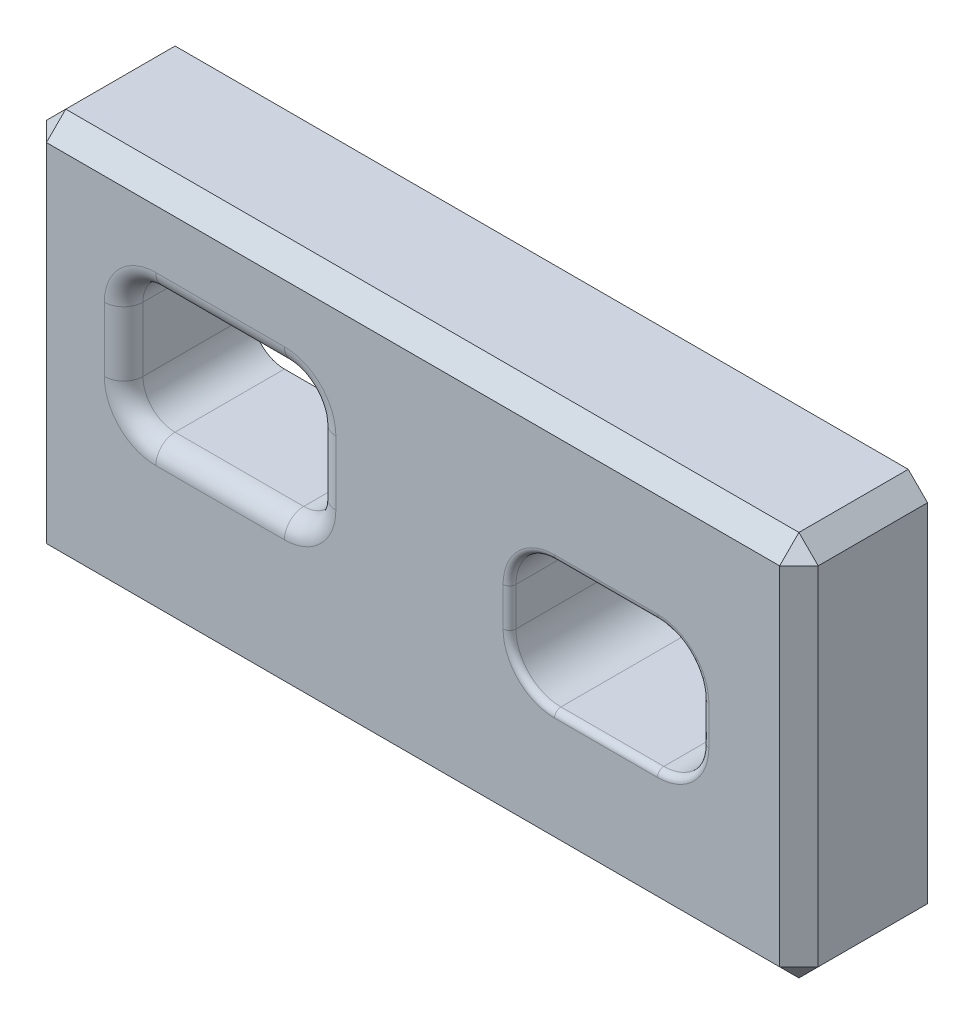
ISO-10303-21;
HEADER;
FILE_DESCRIPTION(('STEP AP214'),'2;1');
FILE_NAME('part.step','',(''),(''),'','','');
FILE_SCHEMA(('AUTOMOTIVE_DESIGN { 1 0 10303 214 1 1 1 1 }'));
ENDSEC;
DATA;
#1=APPLICATION_CONTEXT('core data for automotive mechanical design processes');
#2=APPLICATION_PROTOCOL_DEFINITION('international standard','automotive_design',2000,#1);
#3=PRODUCT_CONTEXT('',#1,'mechanical');
#4=PRODUCT('Part','Part','',(#3));
#5=PRODUCT_RELATED_PRODUCT_CATEGORY('part','',(#4));
#6=PRODUCT_DEFINITION_FORMATION('','',#4);
#7=PRODUCT_DEFINITION_CONTEXT('part definition',#1,'design');
#8=PRODUCT_DEFINITION('design','',#6,#7);
#9=PRODUCT_DEFINITION_SHAPE('','',#8);
#10=(LENGTH_UNIT() NAMED_UNIT(*) SI_UNIT(.MILLI.,.METRE.));
#11=(NAMED_UNIT(*) PLANE_ANGLE_UNIT() SI_UNIT($,.RADIAN.));
#12=(NAMED_UNIT(*) SI_UNIT($,.STERADIAN.) SOLID_ANGLE_UNIT());
#13=UNCERTAINTY_MEASURE_WITH_UNIT(LENGTH_MEASURE(1.E-05),#10,'distance_accuracy_value','');
#14=(GEOMETRIC_REPRESENTATION_CONTEXT(3) GLOBAL_UNCERTAINTY_ASSIGNED_CONTEXT((#13)) GLOBAL_UNIT_ASSIGNED_CONTEXT((#10,
#11,#12)) REPRESENTATION_CONTEXT('',''));
#15=CARTESIAN_POINT('',(0.,0.,0.));
#16=DIRECTION('',(0.,0.,1.));
#17=DIRECTION('',(1.,0.,0.));
#18=AXIS2_PLACEMENT_3D('',#15,#16,#17);
#19=CARTESIAN_POINT('',(0.,0.,20.));
#20=DIRECTION('',(1.,0.,0.));
#21=DIRECTION('',(0.,0.,-1.));
#22=AXIS2_PLACEMENT_3D('',#19,#20,#21);
#23=PLANE('',#22);
#24=DIRECTION('',(0.,-1.,0.));
#25=VECTOR('',#24,1.);
#26=CARTESIAN_POINT('',(0.,0.,0.));
#27=LINE('',#26,#25);
#28=CARTESIAN_POINT('',(0.,57.,0.));
#29=VERTEX_POINT('',#28);
#30=CARTESIAN_POINT('',(0.,3.,0.));
#31=VERTEX_POINT('',#30);
#32=EDGE_CURVE('E374',#29,#31,#27,.T.);
#33=ORIENTED_EDGE('',*,*,#32,.T.);
#34=DIRECTION('',(0.,0.,1.));
#35=VECTOR('',#34,1.);
#36=CARTESIAN_POINT('',(0.,3.,20.));
#37=LINE('',#36,#35);
#38=CARTESIAN_POINT('',(0.,3.,17.));
#39=VERTEX_POINT('',#38);
#40=EDGE_CURVE('E443',#31,#39,#37,.T.);
#41=ORIENTED_EDGE('',*,*,#40,.T.);
#42=DIRECTION('',(0.,1.,0.));
#43=VECTOR('',#42,1.);
#44=CARTESIAN_POINT('',(0.,0.,17.));
#45=LINE('',#44,#43);
#46=CARTESIAN_POINT('',(0.,57.,17.));
#47=VERTEX_POINT('',#46);
#48=EDGE_CURVE('E440',#39,#47,#45,.T.);
#49=ORIENTED_EDGE('',*,*,#48,.T.);
#50=DIRECTION('',(0.,0.,-1.));
#51=VECTOR('',#50,1.);
#52=CARTESIAN_POINT('',(0.,57.,20.));
#53=LINE('',#52,#51);
#54=EDGE_CURVE('E438',#47,#29,#53,.T.);
#55=ORIENTED_EDGE('',*,*,#54,.T.);
#56=EDGE_LOOP('',(#33,#41,#49,#55));
#57=FACE_BOUND('',#56,.T.);
#58=ADVANCED_FACE('F33',(#57),#23,.F.);
#59=CARTESIAN_POINT('',(0.,0.,20.));
#60=DIRECTION('',(0.,1.,0.));
#61=DIRECTION('',(0.,0.,1.));
#62=AXIS2_PLACEMENT_3D('',#59,#60,#61);
#63=PLANE('',#62);
#64=DIRECTION('',(-1.,0.,0.));
#65=VECTOR('',#64,1.);
#66=CARTESIAN_POINT('',(0.,0.,17.));
#67=LINE('',#66,#65);
#68=CARTESIAN_POINT('',(117.,0.,17.));
#69=VERTEX_POINT('',#68);
#70=CARTESIAN_POINT('',(3.00000000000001,0.,17.));
#71=VERTEX_POINT('',#70);
#72=EDGE_CURVE('E447',#69,#71,#67,.T.);
#73=ORIENTED_EDGE('',*,*,#72,.T.);
#74=DIRECTION('',(0.,0.,-1.));
#75=VECTOR('',#74,1.);
#76=CARTESIAN_POINT('',(3.00000000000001,0.,20.));
#77=LINE('',#76,#75);
#78=CARTESIAN_POINT('',(3.00000000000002,0.,0.));
#79=VERTEX_POINT('',#78);
#80=EDGE_CURVE('E449',#71,#79,#77,.T.);
#81=ORIENTED_EDGE('',*,*,#80,.T.);
#82=DIRECTION('',(1.,0.,0.));
#83=VECTOR('',#82,1.);
#84=CARTESIAN_POINT('',(0.,0.,0.));
#85=LINE('',#84,#83);
#86=CARTESIAN_POINT('',(117.,0.,0.));
#87=VERTEX_POINT('',#86);
#88=EDGE_CURVE('E533',#79,#87,#85,.T.);
#89=ORIENTED_EDGE('',*,*,#88,.T.);
#90=DIRECTION('',(0.,0.,1.));
#91=VECTOR('',#90,1.);
#92=CARTESIAN_POINT('',(117.,0.,20.));
#93=LINE('',#92,#91);
#94=EDGE_CURVE('E445',#87,#69,#93,.T.);
#95=ORIENTED_EDGE('',*,*,#94,.T.);
#96=EDGE_LOOP('',(#73,#81,#89,#95));
#97=FACE_BOUND('',#96,.T.);
#98=ADVANCED_FACE('F537',(#97),#63,.F.);
#99=CARTESIAN_POINT('',(120.,0.,20.));
#100=DIRECTION('',(-1.,0.,0.));
#101=DIRECTION('',(0.,0.,1.));
#102=AXIS2_PLACEMENT_3D('',#99,#100,#101);
#103=PLANE('',#102);
#104=DIRECTION('',(0.,-1.,0.));
#105=VECTOR('',#104,1.);
#106=CARTESIAN_POINT('',(120.,0.,17.));
#107=LINE('',#106,#105);
#108=CARTESIAN_POINT('',(120.,57.,17.));
#109=VERTEX_POINT('',#108);
#110=CARTESIAN_POINT('',(120.,3.,17.));
#111=VERTEX_POINT('',#110);
#112=EDGE_CURVE('E461',#109,#111,#107,.T.);
#113=ORIENTED_EDGE('',*,*,#112,.T.);
#114=DIRECTION('',(0.,0.,-1.));
#115=VECTOR('',#114,1.);
#116=CARTESIAN_POINT('',(120.,3.,20.));
#117=LINE('',#116,#115);
#118=CARTESIAN_POINT('',(120.,3.00000000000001,0.));
#119=VERTEX_POINT('',#118);
#120=EDGE_CURVE('E463',#111,#119,#117,.T.);
#121=ORIENTED_EDGE('',*,*,#120,.T.);
#122=DIRECTION('',(0.,1.,0.));
#123=VECTOR('',#122,1.);
#124=CARTESIAN_POINT('',(120.,0.,0.));
#125=LINE('',#124,#123);
#126=CARTESIAN_POINT('',(120.,57.,0.));
#127=VERTEX_POINT('',#126);
#128=EDGE_CURVE('E535',#119,#127,#125,.T.);
#129=ORIENTED_EDGE('',*,*,#128,.T.);
#130=DIRECTION('',(0.,0.,1.));
#131=VECTOR('',#130,1.);
#132=CARTESIAN_POINT('',(120.,57.,20.));
#133=LINE('',#132,#131);
#134=EDGE_CURVE('E459',#127,#109,#133,.T.);
#135=ORIENTED_EDGE('',*,*,#134,.T.);
#136=EDGE_LOOP('',(#113,#121,#129,#135));
#137=FACE_BOUND('',#136,.T.);
#138=ADVANCED_FACE('F522',(#137),#103,.F.);
#139=CARTESIAN_POINT('',(0.,60.,20.));
#140=DIRECTION('',(0.,-1.,0.));
#141=DIRECTION('',(0.,0.,-1.));
#142=AXIS2_PLACEMENT_3D('',#139,#140,#141);
#143=PLANE('',#142);
#144=DIRECTION('',(1.,0.,0.));
#145=VECTOR('',#144,1.);
#146=CARTESIAN_POINT('',(0.,60.,17.));
#147=LINE('',#146,#145);
#148=CARTESIAN_POINT('',(3.00000000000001,60.,17.));
#149=VERTEX_POINT('',#148);
#150=CARTESIAN_POINT('',(117.,60.,17.));
#151=VERTEX_POINT('',#150);
#152=EDGE_CURVE('E42',#149,#151,#147,.T.);
#153=ORIENTED_EDGE('',*,*,#152,.T.);
#154=DIRECTION('',(0.,0.,-1.));
#155=VECTOR('',#154,1.);
#156=CARTESIAN_POINT('',(117.,60.,20.));
#157=LINE('',#156,#155);
#158=CARTESIAN_POINT('',(117.,60.,0.));
#159=VERTEX_POINT('',#158);
#160=EDGE_CURVE('E11',#151,#159,#157,.T.);
#161=ORIENTED_EDGE('',*,*,#160,.T.);
#162=DIRECTION('',(-1.,0.,0.));
#163=VECTOR('',#162,1.);
#164=CARTESIAN_POINT('',(0.,60.,0.));
#165=LINE('',#164,#163);
#166=CARTESIAN_POINT('',(3.00000000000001,60.,0.));
#167=VERTEX_POINT('',#166);
#168=EDGE_CURVE('E540',#159,#167,#165,.T.);
#169=ORIENTED_EDGE('',*,*,#168,.T.);
#170=DIRECTION('',(0.,0.,1.));
#171=VECTOR('',#170,1.);
#172=CARTESIAN_POINT('',(3.00000000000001,60.,20.));
#173=LINE('',#172,#171);
#174=EDGE_CURVE('E53',#167,#149,#173,.T.);
#175=ORIENTED_EDGE('',*,*,#174,.T.);
#176=EDGE_LOOP('',(#153,#161,#169,#175));
#177=FACE_BOUND('',#176,.T.);
#178=ADVANCED_FACE('F771',(#177),#143,.F.);
#179=CARTESIAN_POINT('',(0.,60.,20.));
#180=DIRECTION('',(0.,0.,-1.));
#181=DIRECTION('',(-1.,0.,0.));
#182=AXIS2_PLACEMENT_3D('',#179,#180,#181);
#183=PLANE('',#182);
#184=DIRECTION('',(-1.,0.,0.));
#185=VECTOR('',#184,1.);
#186=CARTESIAN_POINT('',(0.,57.,20.));
#187=LINE('',#186,#185);
#188=CARTESIAN_POINT('',(117.,57.,20.));
#189=VERTEX_POINT('',#188);
#190=CARTESIAN_POINT('',(3.00000000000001,57.,20.));
#191=VERTEX_POINT('',#190);
#192=EDGE_CURVE('E408',#189,#191,#187,.T.);
#193=ORIENTED_EDGE('',*,*,#192,.T.);
#194=DIRECTION('',(0.,-1.,0.));
#195=VECTOR('',#194,1.);
#196=CARTESIAN_POINT('',(3.00000000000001,60.,20.));
#197=LINE('',#196,#195);
#198=CARTESIAN_POINT('',(3.00000000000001,3.,20.));
#199=VERTEX_POINT('',#198);
#200=EDGE_CURVE('E435',#191,#199,#197,.T.);
#201=ORIENTED_EDGE('',*,*,#200,.T.);
#202=DIRECTION('',(1.,0.,0.));
#203=VECTOR('',#202,1.);
#204=CARTESIAN_POINT('',(0.,3.,20.));
#205=LINE('',#204,#203);
#206=CARTESIAN_POINT('',(117.,3.,20.));
#207=VERTEX_POINT('',#206);
#208=EDGE_CURVE('E433',#199,#207,#205,.T.);
#209=ORIENTED_EDGE('',*,*,#208,.T.);
#210=DIRECTION('',(0.,1.,0.));
#211=VECTOR('',#210,1.);
#212=CARTESIAN_POINT('',(117.,60.,20.));
#213=LINE('',#212,#211);
#214=EDGE_CURVE('E431',#207,#189,#213,.T.);
#215=ORIENTED_EDGE('',*,*,#214,.T.);
#216=EDGE_LOOP('',(#193,#201,#209,#215));
#217=FACE_BOUND('',#216,.T.);
#218=DIRECTION('',(1.,0.,0.));
#219=VECTOR('',#218,1.);
#220=CARTESIAN_POINT('',(0.,19.,20.));
#221=LINE('',#220,#219);
#222=CARTESIAN_POINT('',(98.,19.,20.));
#223=VERTEX_POINT('',#222);
#224=CARTESIAN_POINT('',(82.,19.,20.));
#225=VERTEX_POINT('',#224);
#226=EDGE_CURVE('E350',#223,#225,#221,.F.);
#227=ORIENTED_EDGE('',*,*,#226,.T.);
#228=CARTESIAN_POINT('',(82.,27.,20.));
#229=DIRECTION('',(0.,0.,-1.));
#230=DIRECTION('',(-1.,0.,0.));
#231=AXIS2_PLACEMENT_3D('',#228,#229,#230);
#232=CIRCLE('',#231,8.);
#233=CARTESIAN_POINT('',(74.,27.,20.));
#234=VERTEX_POINT('',#233);
#235=EDGE_CURVE('E388',#225,#234,#232,.T.);
#236=ORIENTED_EDGE('',*,*,#235,.T.);
#237=DIRECTION('',(0.,-1.,0.));
#238=VECTOR('',#237,1.);
#239=CARTESIAN_POINT('',(74.,60.,20.));
#240=LINE('',#239,#238);
#241=CARTESIAN_POINT('',(74.,33.,20.));
#242=VERTEX_POINT('',#241);
#243=EDGE_CURVE('E386',#234,#242,#240,.F.);
#244=ORIENTED_EDGE('',*,*,#243,.T.);
#245=CARTESIAN_POINT('',(82.,33.,20.));
#246=DIRECTION('',(0.,0.,-1.));
#247=DIRECTION('',(-1.,0.,0.));
#248=AXIS2_PLACEMENT_3D('',#245,#246,#247);
#249=CIRCLE('',#248,8.);
#250=CARTESIAN_POINT('',(82.,41.,20.));
#251=VERTEX_POINT('',#250);
#252=EDGE_CURVE('E384',#242,#251,#249,.T.);
#253=ORIENTED_EDGE('',*,*,#252,.T.);
#254=DIRECTION('',(-1.,0.,0.));
#255=VECTOR('',#254,1.);
#256=CARTESIAN_POINT('',(0.,41.,20.));
#257=LINE('',#256,#255);
#258=CARTESIAN_POINT('',(98.,41.,20.));
#259=VERTEX_POINT('',#258);
#260=EDGE_CURVE('E382',#251,#259,#257,.F.);
#261=ORIENTED_EDGE('',*,*,#260,.T.);
#262=CARTESIAN_POINT('',(98.,33.,20.));
#263=DIRECTION('',(0.,0.,-1.));
#264=DIRECTION('',(-1.,0.,0.));
#265=AXIS2_PLACEMENT_3D('',#262,#263,#264);
#266=CIRCLE('',#265,8.);
#267=CARTESIAN_POINT('',(106.,33.,20.));
#268=VERTEX_POINT('',#267);
#269=EDGE_CURVE('E380',#259,#268,#266,.T.);
#270=ORIENTED_EDGE('',*,*,#269,.T.);
#271=DIRECTION('',(0.,1.,0.));
#272=VECTOR('',#271,1.);
#273=CARTESIAN_POINT('',(106.,60.,20.));
#274=LINE('',#273,#272);
#275=CARTESIAN_POINT('',(106.,27.,20.));
#276=VERTEX_POINT('',#275);
#277=EDGE_CURVE('E378',#268,#276,#274,.F.);
#278=ORIENTED_EDGE('',*,*,#277,.T.);
#279=CARTESIAN_POINT('',(98.,27.,20.));
#280=DIRECTION('',(0.,0.,-1.));
#281=DIRECTION('',(-1.,0.,0.));
#282=AXIS2_PLACEMENT_3D('',#279,#280,#281);
#283=CIRCLE('',#282,8.);
#284=EDGE_CURVE('E376',#276,#223,#283,.T.);
#285=ORIENTED_EDGE('',*,*,#284,.T.);
#286=EDGE_LOOP('',(#227,#236,#244,#253,#261,#270,#278,#285));
#287=FACE_BOUND('',#286,.T.);
#288=DIRECTION('',(1.,0.,0.));
#289=VECTOR('',#288,1.);
#290=CARTESIAN_POINT('',(0.,22.,20.));
#291=LINE('',#290,#289);
#292=CARTESIAN_POINT('',(40.,22.,20.));
#293=VERTEX_POINT('',#292);
#294=CARTESIAN_POINT('',(20.,22.,20.));
#295=VERTEX_POINT('',#294);
#296=EDGE_CURVE('E317',#293,#295,#291,.F.);
#297=ORIENTED_EDGE('',*,*,#296,.T.);
#298=CARTESIAN_POINT('',(20.,30.,20.));
#299=DIRECTION('',(0.,0.,-1.));
#300=DIRECTION('',(-1.,0.,0.));
#301=AXIS2_PLACEMENT_3D('',#298,#299,#300);
#302=CIRCLE('',#301,8.);
#303=CARTESIAN_POINT('',(12.,30.,20.));
#304=VERTEX_POINT('',#303);
#305=EDGE_CURVE('E331',#295,#304,#302,.T.);
#306=ORIENTED_EDGE('',*,*,#305,.T.);
#307=DIRECTION('',(0.,-1.,0.));
#308=VECTOR('',#307,1.);
#309=CARTESIAN_POINT('',(12.,60.,20.));
#310=LINE('',#309,#308);
#311=CARTESIAN_POINT('',(12.,40.,20.));
#312=VERTEX_POINT('',#311);
#313=EDGE_CURVE('E329',#304,#312,#310,.F.);
#314=ORIENTED_EDGE('',*,*,#313,.T.);
#315=CARTESIAN_POINT('',(20.,40.,20.));
#316=DIRECTION('',(0.,0.,-1.));
#317=DIRECTION('',(-1.,0.,0.));
#318=AXIS2_PLACEMENT_3D('',#315,#316,#317);
#319=CIRCLE('',#318,8.);
#320=CARTESIAN_POINT('',(20.,48.,20.));
#321=VERTEX_POINT('',#320);
#322=EDGE_CURVE('E327',#312,#321,#319,.T.);
#323=ORIENTED_EDGE('',*,*,#322,.T.);
#324=DIRECTION('',(-1.,0.,0.));
#325=VECTOR('',#324,1.);
#326=CARTESIAN_POINT('',(0.,48.,20.));
#327=LINE('',#326,#325);
#328=CARTESIAN_POINT('',(40.,48.,20.));
#329=VERTEX_POINT('',#328);
#330=EDGE_CURVE('E325',#321,#329,#327,.F.);
#331=ORIENTED_EDGE('',*,*,#330,.T.);
#332=CARTESIAN_POINT('',(40.,40.,20.));
#333=DIRECTION('',(0.,0.,-1.));
#334=DIRECTION('',(-1.,0.,0.));
#335=AXIS2_PLACEMENT_3D('',#332,#333,#334);
#336=CIRCLE('',#335,8.);
#337=CARTESIAN_POINT('',(48.,40.,20.));
#338=VERTEX_POINT('',#337);
#339=EDGE_CURVE('E323',#329,#338,#336,.T.);
#340=ORIENTED_EDGE('',*,*,#339,.T.);
#341=DIRECTION('',(0.,1.,0.));
#342=VECTOR('',#341,1.);
#343=CARTESIAN_POINT('',(48.,60.,20.));
#344=LINE('',#343,#342);
#345=CARTESIAN_POINT('',(48.,30.,20.));
#346=VERTEX_POINT('',#345);
#347=EDGE_CURVE('E321',#338,#346,#344,.F.);
#348=ORIENTED_EDGE('',*,*,#347,.T.);
#349=CARTESIAN_POINT('',(40.,30.,20.));
#350=DIRECTION('',(0.,0.,-1.));
#351=DIRECTION('',(-1.,0.,0.));
#352=AXIS2_PLACEMENT_3D('',#349,#350,#351);
#353=CIRCLE('',#352,8.);
#354=EDGE_CURVE('E319',#346,#293,#353,.T.);
#355=ORIENTED_EDGE('',*,*,#354,.T.);
#356=EDGE_LOOP('',(#297,#306,#314,#323,#331,#340,#348,#355));
#357=FACE_BOUND('',#356,.T.);
#358=ADVANCED_FACE('F511',(#217,#287,#357),#183,.F.);
#359=CARTESIAN_POINT('',(0.,60.,0.));
#360=DIRECTION('',(0.,0.,-1.));
#361=DIRECTION('',(-1.,0.,0.));
#362=AXIS2_PLACEMENT_3D('',#359,#360,#361);
#363=PLANE('',#362);
#364=DIRECTION('',(0.,1.,0.));
#365=VECTOR('',#364,1.);
#366=CARTESIAN_POINT('',(75.,60.,0.));
#367=LINE('',#366,#365);
#368=CARTESIAN_POINT('',(75.,27.,0.));
#369=VERTEX_POINT('',#368);
#370=CARTESIAN_POINT('',(75.,33.,0.));
#371=VERTEX_POINT('',#370);
#372=EDGE_CURVE('E265',#369,#371,#367,.T.);
#373=ORIENTED_EDGE('',*,*,#372,.F.);
#374=CARTESIAN_POINT('',(82.,27.,0.));
#375=DIRECTION('',(0.,0.,-1.));
#376=DIRECTION('',(-1.,0.,0.));
#377=AXIS2_PLACEMENT_3D('',#374,#375,#376);
#378=CIRCLE('',#377,7.);
#379=CARTESIAN_POINT('',(82.,20.,0.));
#380=VERTEX_POINT('',#379);
#381=EDGE_CURVE('E313',#369,#380,#378,.F.);
#382=ORIENTED_EDGE('',*,*,#381,.T.);
#383=DIRECTION('',(-1.,0.,0.));
#384=VECTOR('',#383,1.);
#385=CARTESIAN_POINT('',(0.,20.,0.));
#386=LINE('',#385,#384);
#387=CARTESIAN_POINT('',(98.,20.,0.));
#388=VERTEX_POINT('',#387);
#389=EDGE_CURVE('E552',#388,#380,#386,.T.);
#390=ORIENTED_EDGE('',*,*,#389,.F.);
#391=CARTESIAN_POINT('',(98.,27.,0.));
#392=DIRECTION('',(0.,0.,-1.));
#393=DIRECTION('',(-1.,0.,0.));
#394=AXIS2_PLACEMENT_3D('',#391,#392,#393);
#395=CIRCLE('',#394,7.);
#396=CARTESIAN_POINT('',(105.,27.,0.));
#397=VERTEX_POINT('',#396);
#398=EDGE_CURVE('E311',#388,#397,#395,.F.);
#399=ORIENTED_EDGE('',*,*,#398,.T.);
#400=DIRECTION('',(0.,-1.,0.));
#401=VECTOR('',#400,1.);
#402=CARTESIAN_POINT('',(105.,60.,0.));
#403=LINE('',#402,#401);
#404=CARTESIAN_POINT('',(105.,33.,0.));
#405=VERTEX_POINT('',#404);
#406=EDGE_CURVE('E555',#405,#397,#403,.T.);
#407=ORIENTED_EDGE('',*,*,#406,.F.);
#408=CARTESIAN_POINT('',(98.,33.,0.));
#409=DIRECTION('',(0.,0.,-1.));
#410=DIRECTION('',(-1.,0.,0.));
#411=AXIS2_PLACEMENT_3D('',#408,#409,#410);
#412=CIRCLE('',#411,7.);
#413=CARTESIAN_POINT('',(98.,40.,0.));
#414=VERTEX_POINT('',#413);
#415=EDGE_CURVE('E309',#405,#414,#412,.F.);
#416=ORIENTED_EDGE('',*,*,#415,.T.);
#417=DIRECTION('',(1.,0.,0.));
#418=VECTOR('',#417,1.);
#419=CARTESIAN_POINT('',(0.,40.,0.));
#420=LINE('',#419,#418);
#421=CARTESIAN_POINT('',(82.,40.,0.));
#422=VERTEX_POINT('',#421);
#423=EDGE_CURVE('E558',#422,#414,#420,.T.);
#424=ORIENTED_EDGE('',*,*,#423,.F.);
#425=CARTESIAN_POINT('',(82.,33.,0.));
#426=DIRECTION('',(0.,0.,-1.));
#427=DIRECTION('',(-1.,0.,0.));
#428=AXIS2_PLACEMENT_3D('',#425,#426,#427);
#429=CIRCLE('',#428,7.);
#430=EDGE_CURVE('E315',#422,#371,#429,.F.);
#431=ORIENTED_EDGE('',*,*,#430,.T.);
#432=EDGE_LOOP('',(#373,#382,#390,#399,#407,#416,#424,#431));
#433=FACE_BOUND('',#432,.T.);
#434=DIRECTION('',(0.,1.,0.));
#435=VECTOR('',#434,1.);
#436=CARTESIAN_POINT('',(15.,60.,0.));
#437=LINE('',#436,#435);
#438=CARTESIAN_POINT('',(15.,30.,0.));
#439=VERTEX_POINT('',#438);
#440=CARTESIAN_POINT('',(15.,40.,0.));
#441=VERTEX_POINT('',#440);
#442=EDGE_CURVE('E276',#439,#441,#437,.T.);
#443=ORIENTED_EDGE('',*,*,#442,.F.);
#444=CARTESIAN_POINT('',(20.,30.,0.));
#445=DIRECTION('',(0.,0.,-1.));
#446=DIRECTION('',(-1.,0.,0.));
#447=AXIS2_PLACEMENT_3D('',#444,#445,#446);
#448=CIRCLE('',#447,5.);
#449=CARTESIAN_POINT('',(20.,25.,0.));
#450=VERTEX_POINT('',#449);
#451=EDGE_CURVE('E284',#439,#450,#448,.F.);
#452=ORIENTED_EDGE('',*,*,#451,.T.);
#453=DIRECTION('',(-1.,0.,0.));
#454=VECTOR('',#453,1.);
#455=CARTESIAN_POINT('',(0.,25.,0.));
#456=LINE('',#455,#454);
#457=CARTESIAN_POINT('',(40.,25.,0.));
#458=VERTEX_POINT('',#457);
#459=EDGE_CURVE('E546',#458,#450,#456,.T.);
#460=ORIENTED_EDGE('',*,*,#459,.F.);
#461=CARTESIAN_POINT('',(40.,30.,0.));
#462=DIRECTION('',(0.,0.,-1.));
#463=DIRECTION('',(-1.,0.,0.));
#464=AXIS2_PLACEMENT_3D('',#461,#462,#463);
#465=CIRCLE('',#464,5.);
#466=CARTESIAN_POINT('',(45.,30.,0.));
#467=VERTEX_POINT('',#466);
#468=EDGE_CURVE('E288',#458,#467,#465,.F.);
#469=ORIENTED_EDGE('',*,*,#468,.T.);
#470=DIRECTION('',(0.,-1.,0.));
#471=VECTOR('',#470,1.);
#472=CARTESIAN_POINT('',(45.,60.,0.));
#473=LINE('',#472,#471);
#474=CARTESIAN_POINT('',(45.,40.,0.));
#475=VERTEX_POINT('',#474);
#476=EDGE_CURVE('E277',#475,#467,#473,.T.);
#477=ORIENTED_EDGE('',*,*,#476,.F.);
#478=CARTESIAN_POINT('',(40.,40.,0.));
#479=DIRECTION('',(0.,0.,-1.));
#480=DIRECTION('',(-1.,0.,0.));
#481=AXIS2_PLACEMENT_3D('',#478,#479,#480);
#482=CIRCLE('',#481,5.);
#483=CARTESIAN_POINT('',(40.,45.,0.));
#484=VERTEX_POINT('',#483);
#485=EDGE_CURVE('E275',#475,#484,#482,.F.);
#486=ORIENTED_EDGE('',*,*,#485,.T.);
#487=DIRECTION('',(1.,0.,0.));
#488=VECTOR('',#487,1.);
#489=CARTESIAN_POINT('',(0.,45.,0.));
#490=LINE('',#489,#488);
#491=CARTESIAN_POINT('',(20.,45.,0.));
#492=VERTEX_POINT('',#491);
#493=EDGE_CURVE('E257',#492,#484,#490,.T.);
#494=ORIENTED_EDGE('',*,*,#493,.F.);
#495=CARTESIAN_POINT('',(20.,40.,0.));
#496=DIRECTION('',(0.,0.,-1.));
#497=DIRECTION('',(-1.,0.,0.));
#498=AXIS2_PLACEMENT_3D('',#495,#496,#497);
#499=CIRCLE('',#498,5.);
#500=EDGE_CURVE('E271',#492,#441,#499,.F.);
#501=ORIENTED_EDGE('',*,*,#500,.T.);
#502=EDGE_LOOP('',(#443,#452,#460,#469,#477,#486,#494,#501));
#503=FACE_BOUND('',#502,.T.);
#504=ORIENTED_EDGE('',*,*,#88,.F.);
#505=DIRECTION('',(0.70710678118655,-0.707106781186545,0.));
#506=VECTOR('',#505,1.);
#507=CARTESIAN_POINT('',(-28.5,31.4999999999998,0.));
#508=LINE('',#507,#506);
#509=EDGE_CURVE('E457',#79,#31,#508,.F.);
#510=ORIENTED_EDGE('',*,*,#509,.T.);
#511=ORIENTED_EDGE('',*,*,#32,.F.);
#512=DIRECTION('',(-0.70710678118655,-0.707106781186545,0.));
#513=VECTOR('',#512,1.);
#514=CARTESIAN_POINT('',(1.5,58.5,0.));
#515=LINE('',#514,#513);
#516=EDGE_CURVE('E451',#29,#167,#515,.F.);
#517=ORIENTED_EDGE('',*,*,#516,.T.);
#518=ORIENTED_EDGE('',*,*,#168,.F.);
#519=DIRECTION('',(-0.70710678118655,0.707106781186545,0.));
#520=VECTOR('',#519,1.);
#521=CARTESIAN_POINT('',(58.4999999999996,118.5,0.));
#522=LINE('',#521,#520);
#523=EDGE_CURVE('E453',#159,#127,#522,.F.);
#524=ORIENTED_EDGE('',*,*,#523,.T.);
#525=ORIENTED_EDGE('',*,*,#128,.F.);
#526=DIRECTION('',(0.70710678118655,0.707106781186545,0.));
#527=VECTOR('',#526,1.);
#528=CARTESIAN_POINT('',(88.4999999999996,-28.5000000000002,0.));
#529=LINE('',#528,#527);
#530=EDGE_CURVE('E455',#119,#87,#529,.F.);
#531=ORIENTED_EDGE('',*,*,#530,.T.);
#532=EDGE_LOOP('',(#504,#510,#511,#517,#518,#524,#525,#531));
#533=FACE_BOUND('',#532,.T.);
#534=ADVANCED_FACE('F269',(#433,#503,#533),#363,.T.);
#535=CARTESIAN_POINT('',(15.,45.,-5.35726065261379));
#536=DIRECTION('',(-1.,0.,0.));
#537=DIRECTION('',(0.,-1.,0.));
#538=AXIS2_PLACEMENT_3D('',#535,#536,#537);
#539=PLANE('',#538);
#540=DIRECTION('',(0.,0.,1.));
#541=VECTOR('',#540,1.);
#542=CARTESIAN_POINT('',(15.,40.,20.));
#543=LINE('',#542,#541);
#544=CARTESIAN_POINT('',(15.,40.,17.));
#545=VERTEX_POINT('',#544);
#546=EDGE_CURVE('E282',#441,#545,#543,.T.);
#547=ORIENTED_EDGE('',*,*,#546,.T.);
#548=DIRECTION('',(0.,-1.,0.));
#549=VECTOR('',#548,1.);
#550=CARTESIAN_POINT('',(15.,45.,17.));
#551=LINE('',#550,#549);
#552=CARTESIAN_POINT('',(15.,30.,17.));
#553=VERTEX_POINT('',#552);
#554=EDGE_CURVE('E337',#545,#553,#551,.T.);
#555=ORIENTED_EDGE('',*,*,#554,.T.);
#556=DIRECTION('',(0.,0.,1.));
#557=VECTOR('',#556,1.);
#558=CARTESIAN_POINT('',(15.,30.,0.));
#559=LINE('',#558,#557);
#560=EDGE_CURVE('E575',#553,#439,#559,.F.);
#561=ORIENTED_EDGE('',*,*,#560,.T.);
#562=ORIENTED_EDGE('',*,*,#442,.T.);
#563=EDGE_LOOP('',(#547,#555,#561,#562));
#564=FACE_BOUND('',#563,.T.);
#565=ADVANCED_FACE('F621',(#564),#539,.F.);
#566=CARTESIAN_POINT('',(15.,45.,-5.35726065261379));
#567=DIRECTION('',(0.,1.,0.));
#568=DIRECTION('',(0.,0.,1.));
#569=AXIS2_PLACEMENT_3D('',#566,#567,#568);
#570=PLANE('',#569);
#571=DIRECTION('',(0.,0.,1.));
#572=VECTOR('',#571,1.);
#573=CARTESIAN_POINT('',(40.,45.,20.));
#574=LINE('',#573,#572);
#575=CARTESIAN_POINT('',(40.,45.,17.));
#576=VERTEX_POINT('',#575);
#577=EDGE_CURVE('E264',#484,#576,#574,.T.);
#578=ORIENTED_EDGE('',*,*,#577,.T.);
#579=DIRECTION('',(-1.,0.,0.));
#580=VECTOR('',#579,1.);
#581=CARTESIAN_POINT('',(15.,45.,17.));
#582=LINE('',#581,#580);
#583=CARTESIAN_POINT('',(20.,45.,17.));
#584=VERTEX_POINT('',#583);
#585=EDGE_CURVE('E260',#576,#584,#582,.T.);
#586=ORIENTED_EDGE('',*,*,#585,.T.);
#587=DIRECTION('',(0.,0.,1.));
#588=VECTOR('',#587,1.);
#589=CARTESIAN_POINT('',(20.,45.,0.));
#590=LINE('',#589,#588);
#591=EDGE_CURVE('E253',#584,#492,#590,.F.);
#592=ORIENTED_EDGE('',*,*,#591,.T.);
#593=ORIENTED_EDGE('',*,*,#493,.T.);
#594=EDGE_LOOP('',(#578,#586,#592,#593));
#595=FACE_BOUND('',#594,.T.);
#596=ADVANCED_FACE('F256',(#595),#570,.F.);
#597=CARTESIAN_POINT('',(45.,45.,-5.35726065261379));
#598=DIRECTION('',(1.,0.,0.));
#599=DIRECTION('',(0.,0.,-1.));
#600=AXIS2_PLACEMENT_3D('',#597,#598,#599);
#601=PLANE('',#600);
#602=DIRECTION('',(0.,0.,1.));
#603=VECTOR('',#602,1.);
#604=CARTESIAN_POINT('',(45.,30.,20.));
#605=LINE('',#604,#603);
#606=CARTESIAN_POINT('',(45.,30.,17.));
#607=VERTEX_POINT('',#606);
#608=EDGE_CURVE('E564',#467,#607,#605,.T.);
#609=ORIENTED_EDGE('',*,*,#608,.T.);
#610=DIRECTION('',(0.,1.,0.));
#611=VECTOR('',#610,1.);
#612=CARTESIAN_POINT('',(45.,45.,17.));
#613=LINE('',#612,#611);
#614=CARTESIAN_POINT('',(45.,40.,17.));
#615=VERTEX_POINT('',#614);
#616=EDGE_CURVE('E344',#607,#615,#613,.T.);
#617=ORIENTED_EDGE('',*,*,#616,.T.);
#618=DIRECTION('',(0.,0.,1.));
#619=VECTOR('',#618,1.);
#620=CARTESIAN_POINT('',(45.,40.,0.));
#621=LINE('',#620,#619);
#622=EDGE_CURVE('E567',#615,#475,#621,.F.);
#623=ORIENTED_EDGE('',*,*,#622,.T.);
#624=ORIENTED_EDGE('',*,*,#476,.T.);
#625=EDGE_LOOP('',(#609,#617,#623,#624));
#626=FACE_BOUND('',#625,.T.);
#627=ADVANCED_FACE('F583',(#626),#601,.F.);
#628=CARTESIAN_POINT('',(15.,25.,-5.35726065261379));
#629=DIRECTION('',(0.,-1.,0.));
#630=DIRECTION('',(0.,0.,-1.));
#631=AXIS2_PLACEMENT_3D('',#628,#629,#630);
#632=PLANE('',#631);
#633=DIRECTION('',(0.,0.,1.));
#634=VECTOR('',#633,1.);
#635=CARTESIAN_POINT('',(20.,25.,20.));
#636=LINE('',#635,#634);
#637=CARTESIAN_POINT('',(20.,25.,17.));
#638=VERTEX_POINT('',#637);
#639=EDGE_CURVE('E569',#450,#638,#636,.T.);
#640=ORIENTED_EDGE('',*,*,#639,.T.);
#641=DIRECTION('',(1.,0.,0.));
#642=VECTOR('',#641,1.);
#643=CARTESIAN_POINT('',(15.,25.,17.));
#644=LINE('',#643,#642);
#645=CARTESIAN_POINT('',(40.,25.,17.));
#646=VERTEX_POINT('',#645);
#647=EDGE_CURVE('E348',#638,#646,#644,.T.);
#648=ORIENTED_EDGE('',*,*,#647,.T.);
#649=DIRECTION('',(0.,0.,1.));
#650=VECTOR('',#649,1.);
#651=CARTESIAN_POINT('',(40.,25.,0.));
#652=LINE('',#651,#650);
#653=EDGE_CURVE('E572',#646,#458,#652,.F.);
#654=ORIENTED_EDGE('',*,*,#653,.T.);
#655=ORIENTED_EDGE('',*,*,#459,.T.);
#656=EDGE_LOOP('',(#640,#648,#654,#655));
#657=FACE_BOUND('',#656,.T.);
#658=ADVANCED_FACE('F629',(#657),#632,.F.);
#659=CARTESIAN_POINT('',(75.,40.,-5.35726065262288));
#660=DIRECTION('',(-1.,0.,0.));
#661=DIRECTION('',(0.,0.,1.));
#662=AXIS2_PLACEMENT_3D('',#659,#660,#661);
#663=PLANE('',#662);
#664=DIRECTION('',(0.,0.,1.));
#665=VECTOR('',#664,1.);
#666=CARTESIAN_POINT('',(75.,33.,19.9999999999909));
#667=LINE('',#666,#665);
#668=CARTESIAN_POINT('',(75.,33.,19.));
#669=VERTEX_POINT('',#668);
#670=EDGE_CURVE('E304',#371,#669,#667,.T.);
#671=ORIENTED_EDGE('',*,*,#670,.T.);
#672=DIRECTION('',(0.,-1.,0.));
#673=VECTOR('',#672,1.);
#674=CARTESIAN_POINT('',(75.,40.,19.));
#675=LINE('',#674,#673);
#676=CARTESIAN_POINT('',(75.,27.,19.));
#677=VERTEX_POINT('',#676);
#678=EDGE_CURVE('E394',#669,#677,#675,.T.);
#679=ORIENTED_EDGE('',*,*,#678,.T.);
#680=DIRECTION('',(0.,0.,1.));
#681=VECTOR('',#680,1.);
#682=CARTESIAN_POINT('',(75.,27.,0.));
#683=LINE('',#682,#681);
#684=EDGE_CURVE('E307',#677,#369,#683,.F.);
#685=ORIENTED_EDGE('',*,*,#684,.T.);
#686=ORIENTED_EDGE('',*,*,#372,.T.);
#687=EDGE_LOOP('',(#671,#679,#685,#686));
#688=FACE_BOUND('',#687,.T.);
#689=ADVANCED_FACE('F631',(#688),#663,.F.);
#690=CARTESIAN_POINT('',(75.,40.,-5.35726065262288));
#691=DIRECTION('',(0.,1.,0.));
#692=DIRECTION('',(0.,0.,1.));
#693=AXIS2_PLACEMENT_3D('',#690,#691,#692);
#694=PLANE('',#693);
#695=DIRECTION('',(0.,0.,1.));
#696=VECTOR('',#695,1.);
#697=CARTESIAN_POINT('',(98.,40.,19.9999999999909));
#698=LINE('',#697,#696);
#699=CARTESIAN_POINT('',(98.,40.,19.));
#700=VERTEX_POINT('',#699);
#701=EDGE_CURVE('E286',#414,#700,#698,.T.);
#702=ORIENTED_EDGE('',*,*,#701,.T.);
#703=DIRECTION('',(-1.,0.,0.));
#704=VECTOR('',#703,1.);
#705=CARTESIAN_POINT('',(75.,40.,19.));
#706=LINE('',#705,#704);
#707=CARTESIAN_POINT('',(82.,40.,19.));
#708=VERTEX_POINT('',#707);
#709=EDGE_CURVE('E398',#700,#708,#706,.T.);
#710=ORIENTED_EDGE('',*,*,#709,.T.);
#711=DIRECTION('',(0.,0.,1.));
#712=VECTOR('',#711,1.);
#713=CARTESIAN_POINT('',(82.,40.,0.));
#714=LINE('',#713,#712);
#715=EDGE_CURVE('E283',#708,#422,#714,.F.);
#716=ORIENTED_EDGE('',*,*,#715,.T.);
#717=ORIENTED_EDGE('',*,*,#423,.T.);
#718=EDGE_LOOP('',(#702,#710,#716,#717));
#719=FACE_BOUND('',#718,.T.);
#720=ADVANCED_FACE('F637',(#719),#694,.F.);
#721=CARTESIAN_POINT('',(105.,40.,-5.35726065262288));
#722=DIRECTION('',(1.,0.,0.));
#723=DIRECTION('',(0.,0.,-1.));
#724=AXIS2_PLACEMENT_3D('',#721,#722,#723);
#725=PLANE('',#724);
#726=DIRECTION('',(0.,0.,1.));
#727=VECTOR('',#726,1.);
#728=CARTESIAN_POINT('',(105.,27.,19.9999999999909));
#729=LINE('',#728,#727);
#730=CARTESIAN_POINT('',(105.,27.,19.));
#731=VERTEX_POINT('',#730);
#732=EDGE_CURVE('E294',#397,#731,#729,.T.);
#733=ORIENTED_EDGE('',*,*,#732,.T.);
#734=DIRECTION('',(0.,1.,0.));
#735=VECTOR('',#734,1.);
#736=CARTESIAN_POINT('',(105.,40.,19.));
#737=LINE('',#736,#735);
#738=CARTESIAN_POINT('',(105.,33.,19.));
#739=VERTEX_POINT('',#738);
#740=EDGE_CURVE('E402',#731,#739,#737,.T.);
#741=ORIENTED_EDGE('',*,*,#740,.T.);
#742=DIRECTION('',(0.,0.,1.));
#743=VECTOR('',#742,1.);
#744=CARTESIAN_POINT('',(105.,33.,0.));
#745=LINE('',#744,#743);
#746=EDGE_CURVE('E297',#739,#405,#745,.F.);
#747=ORIENTED_EDGE('',*,*,#746,.T.);
#748=ORIENTED_EDGE('',*,*,#406,.T.);
#749=EDGE_LOOP('',(#733,#741,#747,#748));
#750=FACE_BOUND('',#749,.T.);
#751=ADVANCED_FACE('F799',(#750),#725,.F.);
#752=CARTESIAN_POINT('',(75.,20.,-5.35726065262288));
#753=DIRECTION('',(0.,-1.,0.));
#754=DIRECTION('',(0.,0.,-1.));
#755=AXIS2_PLACEMENT_3D('',#752,#753,#754);
#756=PLANE('',#755);
#757=DIRECTION('',(0.,0.,1.));
#758=VECTOR('',#757,1.);
#759=CARTESIAN_POINT('',(82.,20.,20.));
#760=LINE('',#759,#758);
#761=CARTESIAN_POINT('',(82.,20.,19.));
#762=VERTEX_POINT('',#761);
#763=EDGE_CURVE('E299',#380,#762,#760,.T.);
#764=ORIENTED_EDGE('',*,*,#763,.T.);
#765=DIRECTION('',(1.,0.,0.));
#766=VECTOR('',#765,1.);
#767=CARTESIAN_POINT('',(75.,20.,19.));
#768=LINE('',#767,#766);
#769=CARTESIAN_POINT('',(98.,20.,19.));
#770=VERTEX_POINT('',#769);
#771=EDGE_CURVE('E406',#762,#770,#768,.T.);
#772=ORIENTED_EDGE('',*,*,#771,.T.);
#773=DIRECTION('',(0.,0.,1.));
#774=VECTOR('',#773,1.);
#775=CARTESIAN_POINT('',(98.,20.,0.));
#776=LINE('',#775,#774);
#777=EDGE_CURVE('E302',#770,#388,#776,.F.);
#778=ORIENTED_EDGE('',*,*,#777,.T.);
#779=ORIENTED_EDGE('',*,*,#389,.T.);
#780=EDGE_LOOP('',(#764,#772,#778,#779));
#781=FACE_BOUND('',#780,.T.);
#782=ADVANCED_FACE('F653',(#781),#756,.F.);
#783=CARTESIAN_POINT('',(40.,40.,-5.35726065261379));
#784=DIRECTION('',(0.,0.,-1.));
#785=DIRECTION('',(-1.,0.,0.));
#786=AXIS2_PLACEMENT_3D('',#783,#784,#785);
#787=CYLINDRICAL_SURFACE('',#786,5.);
#788=ORIENTED_EDGE('',*,*,#622,.F.);
#789=CARTESIAN_POINT('',(40.,40.,17.));
#790=DIRECTION('',(0.,0.,-1.));
#791=DIRECTION('',(-1.,0.,0.));
#792=AXIS2_PLACEMENT_3D('',#789,#790,#791);
#793=CIRCLE('',#792,5.);
#794=EDGE_CURVE('E342',#615,#576,#793,.F.);
#795=ORIENTED_EDGE('',*,*,#794,.T.);
#796=ORIENTED_EDGE('',*,*,#577,.F.);
#797=ORIENTED_EDGE('',*,*,#485,.F.);
#798=EDGE_LOOP('',(#788,#795,#796,#797));
#799=FACE_BOUND('',#798,.T.);
#800=ADVANCED_FACE('F607',(#799),#787,.F.);
#801=CARTESIAN_POINT('',(40.,30.,-5.35726065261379));
#802=DIRECTION('',(0.,0.,-1.));
#803=DIRECTION('',(-1.,0.,0.));
#804=AXIS2_PLACEMENT_3D('',#801,#802,#803);
#805=CYLINDRICAL_SURFACE('',#804,5.);
#806=ORIENTED_EDGE('',*,*,#653,.F.);
#807=CARTESIAN_POINT('',(40.,30.,17.));
#808=DIRECTION('',(0.,0.,-1.));
#809=DIRECTION('',(-1.,0.,0.));
#810=AXIS2_PLACEMENT_3D('',#807,#808,#809);
#811=CIRCLE('',#810,5.);
#812=EDGE_CURVE('E346',#646,#607,#811,.F.);
#813=ORIENTED_EDGE('',*,*,#812,.T.);
#814=ORIENTED_EDGE('',*,*,#608,.F.);
#815=ORIENTED_EDGE('',*,*,#468,.F.);
#816=EDGE_LOOP('',(#806,#813,#814,#815));
#817=FACE_BOUND('',#816,.T.);
#818=ADVANCED_FACE('F586',(#817),#805,.F.);
#819=CARTESIAN_POINT('',(20.,30.,-5.35726065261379));
#820=DIRECTION('',(0.,0.,-1.));
#821=DIRECTION('',(-1.,0.,0.));
#822=AXIS2_PLACEMENT_3D('',#819,#820,#821);
#823=CYLINDRICAL_SURFACE('',#822,5.);
#824=ORIENTED_EDGE('',*,*,#560,.F.);
#825=CARTESIAN_POINT('',(20.,30.,17.));
#826=DIRECTION('',(0.,0.,-1.));
#827=DIRECTION('',(-1.,0.,0.));
#828=AXIS2_PLACEMENT_3D('',#825,#826,#827);
#829=CIRCLE('',#828,5.);
#830=EDGE_CURVE('E334',#553,#638,#829,.F.);
#831=ORIENTED_EDGE('',*,*,#830,.T.);
#832=ORIENTED_EDGE('',*,*,#639,.F.);
#833=ORIENTED_EDGE('',*,*,#451,.F.);
#834=EDGE_LOOP('',(#824,#831,#832,#833));
#835=FACE_BOUND('',#834,.T.);
#836=ADVANCED_FACE('F626',(#835),#823,.F.);
#837=CARTESIAN_POINT('',(20.,40.,-5.35726065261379));
#838=DIRECTION('',(0.,0.,-1.));
#839=DIRECTION('',(-1.,0.,0.));
#840=AXIS2_PLACEMENT_3D('',#837,#838,#839);
#841=CYLINDRICAL_SURFACE('',#840,5.);
#842=ORIENTED_EDGE('',*,*,#591,.F.);
#843=CARTESIAN_POINT('',(20.,40.,17.));
#844=DIRECTION('',(0.,0.,-1.));
#845=DIRECTION('',(-1.,0.,0.));
#846=AXIS2_PLACEMENT_3D('',#843,#844,#845);
#847=CIRCLE('',#846,5.);
#848=EDGE_CURVE('E339',#584,#545,#847,.F.);
#849=ORIENTED_EDGE('',*,*,#848,.T.);
#850=ORIENTED_EDGE('',*,*,#546,.F.);
#851=ORIENTED_EDGE('',*,*,#500,.F.);
#852=EDGE_LOOP('',(#842,#849,#850,#851));
#853=FACE_BOUND('',#852,.T.);
#854=ADVANCED_FACE('F280',(#853),#841,.F.);
#855=CARTESIAN_POINT('',(98.,33.,-5.35726065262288));
#856=DIRECTION('',(0.,0.,-1.));
#857=DIRECTION('',(-1.,0.,0.));
#858=AXIS2_PLACEMENT_3D('',#855,#856,#857);
#859=CYLINDRICAL_SURFACE('',#858,7.);
#860=ORIENTED_EDGE('',*,*,#746,.F.);
#861=CARTESIAN_POINT('',(98.,33.,19.));
#862=DIRECTION('',(0.,0.,-1.));
#863=DIRECTION('',(-1.,0.,0.));
#864=AXIS2_PLACEMENT_3D('',#861,#862,#863);
#865=CIRCLE('',#864,7.);
#866=EDGE_CURVE('E400',#739,#700,#865,.F.);
#867=ORIENTED_EDGE('',*,*,#866,.T.);
#868=ORIENTED_EDGE('',*,*,#701,.F.);
#869=ORIENTED_EDGE('',*,*,#415,.F.);
#870=EDGE_LOOP('',(#860,#867,#868,#869));
#871=FACE_BOUND('',#870,.T.);
#872=ADVANCED_FACE('F660',(#871),#859,.F.);
#873=CARTESIAN_POINT('',(98.,27.,-5.35726065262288));
#874=DIRECTION('',(0.,0.,-1.));
#875=DIRECTION('',(-1.,0.,0.));
#876=AXIS2_PLACEMENT_3D('',#873,#874,#875);
#877=CYLINDRICAL_SURFACE('',#876,7.);
#878=ORIENTED_EDGE('',*,*,#777,.F.);
#879=CARTESIAN_POINT('',(98.,27.,19.));
#880=DIRECTION('',(0.,0.,-1.));
#881=DIRECTION('',(-1.,0.,0.));
#882=AXIS2_PLACEMENT_3D('',#879,#880,#881);
#883=CIRCLE('',#882,7.);
#884=EDGE_CURVE('E404',#770,#731,#883,.F.);
#885=ORIENTED_EDGE('',*,*,#884,.T.);
#886=ORIENTED_EDGE('',*,*,#732,.F.);
#887=ORIENTED_EDGE('',*,*,#398,.F.);
#888=EDGE_LOOP('',(#878,#885,#886,#887));
#889=FACE_BOUND('',#888,.T.);
#890=ADVANCED_FACE('F663',(#889),#877,.F.);
#891=CARTESIAN_POINT('',(82.,27.,-5.35726065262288));
#892=DIRECTION('',(0.,0.,-1.));
#893=DIRECTION('',(-1.,0.,0.));
#894=AXIS2_PLACEMENT_3D('',#891,#892,#893);
#895=CYLINDRICAL_SURFACE('',#894,7.);
#896=ORIENTED_EDGE('',*,*,#684,.F.);
#897=CARTESIAN_POINT('',(82.,27.,19.));
#898=DIRECTION('',(0.,0.,-1.));
#899=DIRECTION('',(-1.,0.,0.));
#900=AXIS2_PLACEMENT_3D('',#897,#898,#899);
#901=CIRCLE('',#900,7.);
#902=EDGE_CURVE('E391',#677,#762,#901,.F.);
#903=ORIENTED_EDGE('',*,*,#902,.T.);
#904=ORIENTED_EDGE('',*,*,#763,.F.);
#905=ORIENTED_EDGE('',*,*,#381,.F.);
#906=EDGE_LOOP('',(#896,#903,#904,#905));
#907=FACE_BOUND('',#906,.T.);
#908=ADVANCED_FACE('F667',(#907),#895,.F.);
#909=CARTESIAN_POINT('',(82.,33.,-5.35726065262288));
#910=DIRECTION('',(0.,0.,-1.));
#911=DIRECTION('',(-1.,0.,0.));
#912=AXIS2_PLACEMENT_3D('',#909,#910,#911);
#913=CYLINDRICAL_SURFACE('',#912,7.);
#914=ORIENTED_EDGE('',*,*,#715,.F.);
#915=CARTESIAN_POINT('',(82.,33.,19.));
#916=DIRECTION('',(0.,0.,-1.));
#917=DIRECTION('',(-1.,0.,0.));
#918=AXIS2_PLACEMENT_3D('',#915,#916,#917);
#919=CIRCLE('',#918,7.);
#920=EDGE_CURVE('E396',#708,#669,#919,.F.);
#921=ORIENTED_EDGE('',*,*,#920,.T.);
#922=ORIENTED_EDGE('',*,*,#670,.F.);
#923=ORIENTED_EDGE('',*,*,#430,.F.);
#924=EDGE_LOOP('',(#914,#921,#922,#923));
#925=FACE_BOUND('',#924,.T.);
#926=ADVANCED_FACE('F671',(#925),#913,.F.);
#927=CARTESIAN_POINT('',(40.,40.,17.));
#928=DIRECTION('',(0.,0.,-1.));
#929=DIRECTION('',(-1.,0.,0.));
#930=AXIS2_PLACEMENT_3D('',#927,#928,#929);
#931=TOROIDAL_SURFACE('',#930,8.,3.);
#932=CARTESIAN_POINT('',(40.,48.,17.));
#933=DIRECTION('',(-1.,0.,0.));
#934=DIRECTION('',(0.,0.,1.));
#935=AXIS2_PLACEMENT_3D('',#932,#933,#934);
#936=CIRCLE('',#935,3.);
#937=EDGE_CURVE('E368',#576,#329,#936,.T.);
#938=ORIENTED_EDGE('',*,*,#937,.F.);
#939=ORIENTED_EDGE('',*,*,#794,.F.);
#940=CARTESIAN_POINT('',(48.,40.,17.));
#941=DIRECTION('',(0.,-1.,0.));
#942=DIRECTION('',(0.,0.,-1.));
#943=AXIS2_PLACEMENT_3D('',#940,#941,#942);
#944=CIRCLE('',#943,3.);
#945=EDGE_CURVE('E371',#338,#615,#944,.T.);
#946=ORIENTED_EDGE('',*,*,#945,.F.);
#947=ORIENTED_EDGE('',*,*,#339,.F.);
#948=EDGE_LOOP('',(#938,#939,#946,#947));
#949=FACE_BOUND('',#948,.T.);
#950=ADVANCED_FACE('F610',(#949),#931,.T.);
#951=CARTESIAN_POINT('',(48.,45.,17.));
#952=DIRECTION('',(0.,1.,0.));
#953=DIRECTION('',(0.,0.,1.));
#954=AXIS2_PLACEMENT_3D('',#951,#952,#953);
#955=CYLINDRICAL_SURFACE('',#954,3.);
#956=ORIENTED_EDGE('',*,*,#945,.T.);
#957=ORIENTED_EDGE('',*,*,#616,.F.);
#958=CARTESIAN_POINT('',(48.,30.,17.));
#959=DIRECTION('',(0.,-1.,0.));
#960=DIRECTION('',(0.,0.,-1.));
#961=AXIS2_PLACEMENT_3D('',#958,#959,#960);
#962=CIRCLE('',#961,3.);
#963=EDGE_CURVE('E365',#346,#607,#962,.T.);
#964=ORIENTED_EDGE('',*,*,#963,.F.);
#965=ORIENTED_EDGE('',*,*,#347,.F.);
#966=EDGE_LOOP('',(#956,#957,#964,#965));
#967=FACE_BOUND('',#966,.T.);
#968=ADVANCED_FACE('F604',(#967),#955,.T.);
#969=CARTESIAN_POINT('',(15.,48.,17.));
#970=DIRECTION('',(-1.,0.,0.));
#971=DIRECTION('',(0.,0.,1.));
#972=AXIS2_PLACEMENT_3D('',#969,#970,#971);
#973=CYLINDRICAL_SURFACE('',#972,3.);
#974=ORIENTED_EDGE('',*,*,#937,.T.);
#975=ORIENTED_EDGE('',*,*,#330,.F.);
#976=CARTESIAN_POINT('',(20.,48.,17.));
#977=DIRECTION('',(-1.,0.,0.));
#978=DIRECTION('',(0.,0.,1.));
#979=AXIS2_PLACEMENT_3D('',#976,#977,#978);
#980=CIRCLE('',#979,3.);
#981=EDGE_CURVE('E362',#584,#321,#980,.T.);
#982=ORIENTED_EDGE('',*,*,#981,.F.);
#983=ORIENTED_EDGE('',*,*,#585,.F.);
#984=EDGE_LOOP('',(#974,#975,#982,#983));
#985=FACE_BOUND('',#984,.T.);
#986=ADVANCED_FACE('F613',(#985),#973,.T.);
#987=CARTESIAN_POINT('',(40.,30.,17.));
#988=DIRECTION('',(0.,0.,-1.));
#989=DIRECTION('',(-1.,0.,0.));
#990=AXIS2_PLACEMENT_3D('',#987,#988,#989);
#991=TOROIDAL_SURFACE('',#990,8.,3.);
#992=ORIENTED_EDGE('',*,*,#963,.T.);
#993=ORIENTED_EDGE('',*,*,#812,.F.);
#994=CARTESIAN_POINT('',(40.,22.,17.));
#995=DIRECTION('',(-1.,0.,0.));
#996=DIRECTION('',(0.,0.,1.));
#997=AXIS2_PLACEMENT_3D('',#994,#995,#996);
#998=CIRCLE('',#997,3.);
#999=EDGE_CURVE('E359',#293,#646,#998,.T.);
#1000=ORIENTED_EDGE('',*,*,#999,.F.);
#1001=ORIENTED_EDGE('',*,*,#354,.F.);
#1002=EDGE_LOOP('',(#992,#993,#1000,#1001));
#1003=FACE_BOUND('',#1002,.T.);
#1004=ADVANCED_FACE('F590',(#1003),#991,.T.);
#1005=CARTESIAN_POINT('',(20.,40.,17.));
#1006=DIRECTION('',(0.,0.,-1.));
#1007=DIRECTION('',(-1.,0.,0.));
#1008=AXIS2_PLACEMENT_3D('',#1005,#1006,#1007);
#1009=TOROIDAL_SURFACE('',#1008,8.,3.);
#1010=ORIENTED_EDGE('',*,*,#981,.T.);
#1011=ORIENTED_EDGE('',*,*,#322,.F.);
#1012=CARTESIAN_POINT('',(12.,40.,17.));
#1013=DIRECTION('',(0.,-1.,0.));
#1014=DIRECTION('',(0.,0.,-1.));
#1015=AXIS2_PLACEMENT_3D('',#1012,#1013,#1014);
#1016=CIRCLE('',#1015,3.);
#1017=EDGE_CURVE('E356',#545,#312,#1016,.T.);
#1018=ORIENTED_EDGE('',*,*,#1017,.F.);
#1019=ORIENTED_EDGE('',*,*,#848,.F.);
#1020=EDGE_LOOP('',(#1010,#1011,#1018,#1019));
#1021=FACE_BOUND('',#1020,.T.);
#1022=ADVANCED_FACE('F618',(#1021),#1009,.T.);
#1023=CARTESIAN_POINT('',(15.,22.,17.));
#1024=DIRECTION('',(1.,0.,0.));
#1025=DIRECTION('',(0.,0.,-1.));
#1026=AXIS2_PLACEMENT_3D('',#1023,#1024,#1025);
#1027=CYLINDRICAL_SURFACE('',#1026,3.);
#1028=ORIENTED_EDGE('',*,*,#999,.T.);
#1029=ORIENTED_EDGE('',*,*,#647,.F.);
#1030=CARTESIAN_POINT('',(20.,22.,17.));
#1031=DIRECTION('',(-1.,0.,0.));
#1032=DIRECTION('',(0.,0.,1.));
#1033=AXIS2_PLACEMENT_3D('',#1030,#1031,#1032);
#1034=CIRCLE('',#1033,3.);
#1035=EDGE_CURVE('E353',#295,#638,#1034,.T.);
#1036=ORIENTED_EDGE('',*,*,#1035,.F.);
#1037=ORIENTED_EDGE('',*,*,#296,.F.);
#1038=EDGE_LOOP('',(#1028,#1029,#1036,#1037));
#1039=FACE_BOUND('',#1038,.T.);
#1040=ADVANCED_FACE('F596',(#1039),#1027,.T.);
#1041=CARTESIAN_POINT('',(12.,45.,17.));
#1042=DIRECTION('',(0.,-1.,0.));
#1043=DIRECTION('',(1.,0.,0.));
#1044=AXIS2_PLACEMENT_3D('',#1041,#1042,#1043);
#1045=CYLINDRICAL_SURFACE('',#1044,3.);
#1046=ORIENTED_EDGE('',*,*,#1017,.T.);
#1047=ORIENTED_EDGE('',*,*,#313,.F.);
#1048=CARTESIAN_POINT('',(12.,30.,17.));
#1049=DIRECTION('',(0.,-1.,0.));
#1050=DIRECTION('',(0.,0.,-1.));
#1051=AXIS2_PLACEMENT_3D('',#1048,#1049,#1050);
#1052=CIRCLE('',#1051,3.);
#1053=EDGE_CURVE('E351',#553,#304,#1052,.T.);
#1054=ORIENTED_EDGE('',*,*,#1053,.F.);
#1055=ORIENTED_EDGE('',*,*,#554,.F.);
#1056=EDGE_LOOP('',(#1046,#1047,#1054,#1055));
#1057=FACE_BOUND('',#1056,.T.);
#1058=ADVANCED_FACE('F680',(#1057),#1045,.T.);
#1059=CARTESIAN_POINT('',(20.,30.,17.));
#1060=DIRECTION('',(0.,0.,-1.));
#1061=DIRECTION('',(-1.,0.,0.));
#1062=AXIS2_PLACEMENT_3D('',#1059,#1060,#1061);
#1063=TOROIDAL_SURFACE('',#1062,8.,3.);
#1064=ORIENTED_EDGE('',*,*,#1035,.T.);
#1065=ORIENTED_EDGE('',*,*,#830,.F.);
#1066=ORIENTED_EDGE('',*,*,#1053,.T.);
#1067=ORIENTED_EDGE('',*,*,#305,.F.);
#1068=EDGE_LOOP('',(#1064,#1065,#1066,#1067));
#1069=FACE_BOUND('',#1068,.T.);
#1070=ADVANCED_FACE('F676',(#1069),#1063,.T.);
#1071=CARTESIAN_POINT('',(98.,33.,19.));
#1072=DIRECTION('',(0.,0.,-1.));
#1073=DIRECTION('',(-1.,0.,0.));
#1074=AXIS2_PLACEMENT_3D('',#1071,#1072,#1073);
#1075=TOROIDAL_SURFACE('',#1074,8.,1.);
#1076=CARTESIAN_POINT('',(98.,41.,19.));
#1077=DIRECTION('',(-1.,0.,0.));
#1078=DIRECTION('',(0.,0.,1.));
#1079=AXIS2_PLACEMENT_3D('',#1076,#1077,#1078);
#1080=CIRCLE('',#1079,1.);
#1081=EDGE_CURVE('E425',#700,#259,#1080,.T.);
#1082=ORIENTED_EDGE('',*,*,#1081,.F.);
#1083=ORIENTED_EDGE('',*,*,#866,.F.);
#1084=CARTESIAN_POINT('',(106.,33.,19.));
#1085=DIRECTION('',(0.,-1.,0.));
#1086=DIRECTION('',(0.,0.,-1.));
#1087=AXIS2_PLACEMENT_3D('',#1084,#1085,#1086);
#1088=CIRCLE('',#1087,1.);
#1089=EDGE_CURVE('E354',#268,#739,#1088,.T.);
#1090=ORIENTED_EDGE('',*,*,#1089,.F.);
#1091=ORIENTED_EDGE('',*,*,#269,.F.);
#1092=EDGE_LOOP('',(#1082,#1083,#1090,#1091));
#1093=FACE_BOUND('',#1092,.T.);
#1094=ADVANCED_FACE('F679',(#1093),#1075,.T.);
#1095=CARTESIAN_POINT('',(106.,40.,19.));
#1096=DIRECTION('',(0.,1.,0.));
#1097=DIRECTION('',(0.,0.,1.));
#1098=AXIS2_PLACEMENT_3D('',#1095,#1096,#1097);
#1099=CYLINDRICAL_SURFACE('',#1098,1.);
#1100=ORIENTED_EDGE('',*,*,#1089,.T.);
#1101=ORIENTED_EDGE('',*,*,#740,.F.);
#1102=CARTESIAN_POINT('',(106.,27.,19.));
#1103=DIRECTION('',(0.,-1.,0.));
#1104=DIRECTION('',(0.,0.,-1.));
#1105=AXIS2_PLACEMENT_3D('',#1102,#1103,#1104);
#1106=CIRCLE('',#1105,1.);
#1107=EDGE_CURVE('E422',#276,#731,#1106,.T.);
#1108=ORIENTED_EDGE('',*,*,#1107,.F.);
#1109=ORIENTED_EDGE('',*,*,#277,.F.);
#1110=EDGE_LOOP('',(#1100,#1101,#1108,#1109));
#1111=FACE_BOUND('',#1110,.T.);
#1112=ADVANCED_FACE('F720',(#1111),#1099,.T.);
#1113=CARTESIAN_POINT('',(75.,41.,19.));
#1114=DIRECTION('',(-1.,0.,0.));
#1115=DIRECTION('',(0.,0.,1.));
#1116=AXIS2_PLACEMENT_3D('',#1113,#1114,#1115);
#1117=CYLINDRICAL_SURFACE('',#1116,1.);
#1118=ORIENTED_EDGE('',*,*,#1081,.T.);
#1119=ORIENTED_EDGE('',*,*,#260,.F.);
#1120=CARTESIAN_POINT('',(82.,41.,19.));
#1121=DIRECTION('',(-1.,0.,0.));
#1122=DIRECTION('',(0.,0.,1.));
#1123=AXIS2_PLACEMENT_3D('',#1120,#1121,#1122);
#1124=CIRCLE('',#1123,1.);
#1125=EDGE_CURVE('E419',#708,#251,#1124,.T.);
#1126=ORIENTED_EDGE('',*,*,#1125,.F.);
#1127=ORIENTED_EDGE('',*,*,#709,.F.);
#1128=EDGE_LOOP('',(#1118,#1119,#1126,#1127));
#1129=FACE_BOUND('',#1128,.T.);
#1130=ADVANCED_FACE('F716',(#1129),#1117,.T.);
#1131=CARTESIAN_POINT('',(98.,27.,19.));
#1132=DIRECTION('',(0.,0.,-1.));
#1133=DIRECTION('',(-1.,0.,0.));
#1134=AXIS2_PLACEMENT_3D('',#1131,#1132,#1133);
#1135=TOROIDAL_SURFACE('',#1134,8.,1.);
#1136=ORIENTED_EDGE('',*,*,#1107,.T.);
#1137=ORIENTED_EDGE('',*,*,#884,.F.);
#1138=CARTESIAN_POINT('',(98.,19.,19.));
#1139=DIRECTION('',(-1.,0.,0.));
#1140=DIRECTION('',(0.,0.,1.));
#1141=AXIS2_PLACEMENT_3D('',#1138,#1139,#1140);
#1142=CIRCLE('',#1141,1.);
#1143=EDGE_CURVE('E416',#223,#770,#1142,.T.);
#1144=ORIENTED_EDGE('',*,*,#1143,.F.);
#1145=ORIENTED_EDGE('',*,*,#284,.F.);
#1146=EDGE_LOOP('',(#1136,#1137,#1144,#1145));
#1147=FACE_BOUND('',#1146,.T.);
#1148=ADVANCED_FACE('F712',(#1147),#1135,.T.);
#1149=CARTESIAN_POINT('',(82.,33.,19.));
#1150=DIRECTION('',(0.,0.,-1.));
#1151=DIRECTION('',(-1.,0.,0.));
#1152=AXIS2_PLACEMENT_3D('',#1149,#1150,#1151);
#1153=TOROIDAL_SURFACE('',#1152,8.,1.);
#1154=ORIENTED_EDGE('',*,*,#1125,.T.);
#1155=ORIENTED_EDGE('',*,*,#252,.F.);
#1156=CARTESIAN_POINT('',(74.,33.,19.));
#1157=DIRECTION('',(0.,-1.,0.));
#1158=DIRECTION('',(0.,0.,-1.));
#1159=AXIS2_PLACEMENT_3D('',#1156,#1157,#1158);
#1160=CIRCLE('',#1159,1.);
#1161=EDGE_CURVE('E413',#669,#242,#1160,.T.);
#1162=ORIENTED_EDGE('',*,*,#1161,.F.);
#1163=ORIENTED_EDGE('',*,*,#920,.F.);
#1164=EDGE_LOOP('',(#1154,#1155,#1162,#1163));
#1165=FACE_BOUND('',#1164,.T.);
#1166=ADVANCED_FACE('F708',(#1165),#1153,.T.);
#1167=CARTESIAN_POINT('',(75.,19.,19.));
#1168=DIRECTION('',(1.,0.,0.));
#1169=DIRECTION('',(0.,0.,-1.));
#1170=AXIS2_PLACEMENT_3D('',#1167,#1168,#1169);
#1171=CYLINDRICAL_SURFACE('',#1170,1.);
#1172=ORIENTED_EDGE('',*,*,#1143,.T.);
#1173=ORIENTED_EDGE('',*,*,#771,.F.);
#1174=CARTESIAN_POINT('',(82.,19.,19.));
#1175=DIRECTION('',(-1.,0.,0.));
#1176=DIRECTION('',(0.,0.,1.));
#1177=AXIS2_PLACEMENT_3D('',#1174,#1175,#1176);
#1178=CIRCLE('',#1177,1.);
#1179=EDGE_CURVE('E411',#225,#762,#1178,.T.);
#1180=ORIENTED_EDGE('',*,*,#1179,.F.);
#1181=ORIENTED_EDGE('',*,*,#226,.F.);
#1182=EDGE_LOOP('',(#1172,#1173,#1180,#1181));
#1183=FACE_BOUND('',#1182,.T.);
#1184=ADVANCED_FACE('F704',(#1183),#1171,.T.);
#1185=CARTESIAN_POINT('',(74.,40.,19.));
#1186=DIRECTION('',(0.,-1.,0.));
#1187=DIRECTION('',(0.,0.,-1.));
#1188=AXIS2_PLACEMENT_3D('',#1185,#1186,#1187);
#1189=CYLINDRICAL_SURFACE('',#1188,1.);
#1190=ORIENTED_EDGE('',*,*,#1161,.T.);
#1191=ORIENTED_EDGE('',*,*,#243,.F.);
#1192=CARTESIAN_POINT('',(74.,27.,19.));
#1193=DIRECTION('',(0.,-1.,0.));
#1194=DIRECTION('',(0.,0.,-1.));
#1195=AXIS2_PLACEMENT_3D('',#1192,#1193,#1194);
#1196=CIRCLE('',#1195,1.);
#1197=EDGE_CURVE('E409',#677,#234,#1196,.T.);
#1198=ORIENTED_EDGE('',*,*,#1197,.F.);
#1199=ORIENTED_EDGE('',*,*,#678,.F.);
#1200=EDGE_LOOP('',(#1190,#1191,#1198,#1199));
#1201=FACE_BOUND('',#1200,.T.);
#1202=ADVANCED_FACE('F700',(#1201),#1189,.T.);
#1203=CARTESIAN_POINT('',(82.,27.,19.));
#1204=DIRECTION('',(0.,0.,-1.));
#1205=DIRECTION('',(-1.,0.,0.));
#1206=AXIS2_PLACEMENT_3D('',#1203,#1204,#1205);
#1207=TOROIDAL_SURFACE('',#1206,8.,1.);
#1208=ORIENTED_EDGE('',*,*,#1179,.T.);
#1209=ORIENTED_EDGE('',*,*,#902,.F.);
#1210=ORIENTED_EDGE('',*,*,#1197,.T.);
#1211=ORIENTED_EDGE('',*,*,#235,.F.);
#1212=EDGE_LOOP('',(#1208,#1209,#1210,#1211));
#1213=FACE_BOUND('',#1212,.T.);
#1214=ADVANCED_FACE('F697',(#1213),#1207,.T.);
#1215=CARTESIAN_POINT('',(117.,60.,20.));
#1216=DIRECTION('',(-0.707106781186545,-0.70710678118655,0.));
#1217=DIRECTION('',(0.70710678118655,-0.707106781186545,0.));
#1218=AXIS2_PLACEMENT_3D('',#1215,#1216,#1217);
#1219=PLANE('',#1218);
#1220=ORIENTED_EDGE('',*,*,#523,.F.);
#1221=ORIENTED_EDGE('',*,*,#160,.F.);
#1222=DIRECTION('',(0.70710678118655,-0.707106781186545,0.));
#1223=VECTOR('',#1222,1.);
#1224=CARTESIAN_POINT('',(118.5,58.5,17.));
#1225=LINE('',#1224,#1223);
#1226=EDGE_CURVE('E37',#109,#151,#1225,.F.);
#1227=ORIENTED_EDGE('',*,*,#1226,.F.);
#1228=ORIENTED_EDGE('',*,*,#134,.F.);
#1229=EDGE_LOOP('',(#1220,#1221,#1227,#1228));
#1230=FACE_BOUND('',#1229,.T.);
#1231=ADVANCED_FACE('F35',(#1230),#1219,.F.);
#1232=CARTESIAN_POINT('',(117.,60.,20.));
#1233=DIRECTION('',(-0.707106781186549,0.,-0.707106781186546));
#1234=DIRECTION('',(-0.707106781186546,0.,0.707106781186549));
#1235=AXIS2_PLACEMENT_3D('',#1232,#1233,#1234);
#1236=PLANE('',#1235);
#1237=DIRECTION('',(0.707106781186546,0.,-0.707106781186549));
#1238=VECTOR('',#1237,1.);
#1239=CARTESIAN_POINT('',(117.,3.,20.));
#1240=LINE('',#1239,#1238);
#1241=EDGE_CURVE('E492',#111,#207,#1240,.F.);
#1242=ORIENTED_EDGE('',*,*,#1241,.F.);
#1243=ORIENTED_EDGE('',*,*,#112,.F.);
#1244=DIRECTION('',(-0.707106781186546,0.,0.707106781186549));
#1245=VECTOR('',#1244,1.);
#1246=CARTESIAN_POINT('',(117.,57.,20.));
#1247=LINE('',#1246,#1245);
#1248=EDGE_CURVE('E494',#189,#109,#1247,.F.);
#1249=ORIENTED_EDGE('',*,*,#1248,.F.);
#1250=ORIENTED_EDGE('',*,*,#214,.F.);
#1251=EDGE_LOOP('',(#1242,#1243,#1249,#1250));
#1252=FACE_BOUND('',#1251,.T.);
#1253=ADVANCED_FACE('F519',(#1252),#1236,.F.);
#1254=CARTESIAN_POINT('',(120.,3.,20.));
#1255=DIRECTION('',(-0.707106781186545,0.70710678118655,0.));
#1256=DIRECTION('',(-0.70710678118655,-0.707106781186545,0.));
#1257=AXIS2_PLACEMENT_3D('',#1254,#1255,#1256);
#1258=PLANE('',#1257);
#1259=ORIENTED_EDGE('',*,*,#530,.F.);
#1260=ORIENTED_EDGE('',*,*,#120,.F.);
#1261=DIRECTION('',(-0.70710678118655,-0.707106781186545,0.));
#1262=VECTOR('',#1261,1.);
#1263=CARTESIAN_POINT('',(118.5,1.49999999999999,17.));
#1264=LINE('',#1263,#1262);
#1265=EDGE_CURVE('E489',#69,#111,#1264,.F.);
#1266=ORIENTED_EDGE('',*,*,#1265,.F.);
#1267=ORIENTED_EDGE('',*,*,#94,.F.);
#1268=EDGE_LOOP('',(#1259,#1260,#1266,#1267));
#1269=FACE_BOUND('',#1268,.T.);
#1270=ADVANCED_FACE('F528',(#1269),#1258,.F.);
#1271=CARTESIAN_POINT('',(117.,57.,20.));
#1272=DIRECTION('',(0.577350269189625,0.577350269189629,0.577350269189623));
#1273=DIRECTION('',(-0.70710678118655,0.707106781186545,0.));
#1274=AXIS2_PLACEMENT_3D('',#1271,#1272,#1273);
#1275=PLANE('',#1274);
#1276=ORIENTED_EDGE('',*,*,#1248,.T.);
#1277=ORIENTED_EDGE('',*,*,#1226,.T.);
#1278=DIRECTION('',(0.,0.707106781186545,-0.707106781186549));
#1279=VECTOR('',#1278,1.);
#1280=CARTESIAN_POINT('',(117.,57.,20.));
#1281=LINE('',#1280,#1279);
#1282=EDGE_CURVE('E486',#189,#151,#1281,.T.);
#1283=ORIENTED_EDGE('',*,*,#1282,.F.);
#1284=EDGE_LOOP('',(#1276,#1277,#1283));
#1285=FACE_BOUND('',#1284,.T.);
#1286=ADVANCED_FACE('F501',(#1285),#1275,.T.);
#1287=CARTESIAN_POINT('',(117.,3.,20.));
#1288=DIRECTION('',(0.577350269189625,-0.577350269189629,0.577350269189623));
#1289=DIRECTION('',(0.70710678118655,0.707106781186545,0.));
#1290=AXIS2_PLACEMENT_3D('',#1287,#1288,#1289);
#1291=PLANE('',#1290);
#1292=ORIENTED_EDGE('',*,*,#1265,.T.);
#1293=ORIENTED_EDGE('',*,*,#1241,.T.);
#1294=DIRECTION('',(0.,0.707106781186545,0.707106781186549));
#1295=VECTOR('',#1294,1.);
#1296=CARTESIAN_POINT('',(117.,3.,20.));
#1297=LINE('',#1296,#1295);
#1298=EDGE_CURVE('E483',#69,#207,#1297,.T.);
#1299=ORIENTED_EDGE('',*,*,#1298,.F.);
#1300=EDGE_LOOP('',(#1292,#1293,#1299));
#1301=FACE_BOUND('',#1300,.T.);
#1302=ADVANCED_FACE('F753',(#1301),#1291,.T.);
#1303=CARTESIAN_POINT('',(0.,57.,20.));
#1304=DIRECTION('',(0.707106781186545,-0.70710678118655,0.));
#1305=DIRECTION('',(0.70710678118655,0.707106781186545,0.));
#1306=AXIS2_PLACEMENT_3D('',#1303,#1304,#1305);
#1307=PLANE('',#1306);
#1308=ORIENTED_EDGE('',*,*,#516,.F.);
#1309=ORIENTED_EDGE('',*,*,#54,.F.);
#1310=DIRECTION('',(0.70710678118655,0.707106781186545,0.));
#1311=VECTOR('',#1310,1.);
#1312=CARTESIAN_POINT('',(0.,57.,17.));
#1313=LINE('',#1312,#1311);
#1314=EDGE_CURVE('E480',#149,#47,#1313,.F.);
#1315=ORIENTED_EDGE('',*,*,#1314,.F.);
#1316=ORIENTED_EDGE('',*,*,#174,.F.);
#1317=EDGE_LOOP('',(#1308,#1309,#1315,#1316));
#1318=FACE_BOUND('',#1317,.T.);
#1319=ADVANCED_FACE('F750',(#1318),#1307,.F.);
#1320=CARTESIAN_POINT('',(0.,57.,20.));
#1321=DIRECTION('',(0.,-0.70710678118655,-0.707106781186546));
#1322=DIRECTION('',(0.,0.707106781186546,-0.70710678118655));
#1323=AXIS2_PLACEMENT_3D('',#1320,#1321,#1322);
#1324=PLANE('',#1323);
#1325=ORIENTED_EDGE('',*,*,#1282,.T.);
#1326=ORIENTED_EDGE('',*,*,#152,.F.);
#1327=DIRECTION('',(0.,-0.707106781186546,0.707106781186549));
#1328=VECTOR('',#1327,1.);
#1329=CARTESIAN_POINT('',(3.00000000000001,58.5,18.5));
#1330=LINE('',#1329,#1328);
#1331=EDGE_CURVE('E477',#191,#149,#1330,.F.);
#1332=ORIENTED_EDGE('',*,*,#1331,.F.);
#1333=ORIENTED_EDGE('',*,*,#192,.F.);
#1334=EDGE_LOOP('',(#1325,#1326,#1332,#1333));
#1335=FACE_BOUND('',#1334,.T.);
#1336=ADVANCED_FACE('F506',(#1335),#1324,.F.);
#1337=CARTESIAN_POINT('',(0.,3.,20.));
#1338=DIRECTION('',(0.,0.70710678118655,-0.707106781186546));
#1339=DIRECTION('',(0.,0.707106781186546,0.70710678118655));
#1340=AXIS2_PLACEMENT_3D('',#1337,#1338,#1339);
#1341=PLANE('',#1340);
#1342=ORIENTED_EDGE('',*,*,#1298,.T.);
#1343=ORIENTED_EDGE('',*,*,#208,.F.);
#1344=DIRECTION('',(0.,-0.707106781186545,-0.70710678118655));
#1345=VECTOR('',#1344,1.);
#1346=CARTESIAN_POINT('',(3.00000000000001,3.,20.));
#1347=LINE('',#1346,#1345);
#1348=EDGE_CURVE('E474',#71,#199,#1347,.F.);
#1349=ORIENTED_EDGE('',*,*,#1348,.F.);
#1350=ORIENTED_EDGE('',*,*,#72,.F.);
#1351=EDGE_LOOP('',(#1342,#1343,#1349,#1350));
#1352=FACE_BOUND('',#1351,.T.);
#1353=ADVANCED_FACE('F743',(#1352),#1341,.F.);
#1354=CARTESIAN_POINT('',(3.00000000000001,0.,20.));
#1355=DIRECTION('',(0.707106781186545,0.70710678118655,0.));
#1356=DIRECTION('',(-0.70710678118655,0.707106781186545,0.));
#1357=AXIS2_PLACEMENT_3D('',#1354,#1355,#1356);
#1358=PLANE('',#1357);
#1359=ORIENTED_EDGE('',*,*,#509,.F.);
#1360=ORIENTED_EDGE('',*,*,#80,.F.);
#1361=DIRECTION('',(-0.70710678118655,0.707106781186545,0.));
#1362=VECTOR('',#1361,1.);
#1363=CARTESIAN_POINT('',(1.50000000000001,1.5,17.));
#1364=LINE('',#1363,#1362);
#1365=EDGE_CURVE('E471',#39,#71,#1364,.F.);
#1366=ORIENTED_EDGE('',*,*,#1365,.F.);
#1367=ORIENTED_EDGE('',*,*,#40,.F.);
#1368=EDGE_LOOP('',(#1359,#1360,#1366,#1367));
#1369=FACE_BOUND('',#1368,.T.);
#1370=ADVANCED_FACE('F739',(#1369),#1358,.F.);
#1371=CARTESIAN_POINT('',(0.,57.,17.));
#1372=DIRECTION('',(-0.577350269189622,0.577350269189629,0.577350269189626));
#1373=DIRECTION('',(0.,-0.707106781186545,0.70710678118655));
#1374=AXIS2_PLACEMENT_3D('',#1371,#1372,#1373);
#1375=PLANE('',#1374);
#1376=ORIENTED_EDGE('',*,*,#1331,.T.);
#1377=ORIENTED_EDGE('',*,*,#1314,.T.);
#1378=DIRECTION('',(-0.70710678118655,0.,-0.707106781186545));
#1379=VECTOR('',#1378,1.);
#1380=CARTESIAN_POINT('',(0.,57.,17.));
#1381=LINE('',#1380,#1379);
#1382=EDGE_CURVE('E469',#191,#47,#1381,.T.);
#1383=ORIENTED_EDGE('',*,*,#1382,.F.);
#1384=EDGE_LOOP('',(#1376,#1377,#1383));
#1385=FACE_BOUND('',#1384,.T.);
#1386=ADVANCED_FACE('F735',(#1385),#1375,.T.);
#1387=CARTESIAN_POINT('',(3.00000000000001,3.,20.));
#1388=DIRECTION('',(-0.577350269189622,-0.577350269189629,0.577350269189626));
#1389=DIRECTION('',(0.,-0.707106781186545,-0.70710678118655));
#1390=AXIS2_PLACEMENT_3D('',#1387,#1388,#1389);
#1391=PLANE('',#1390);
#1392=ORIENTED_EDGE('',*,*,#1365,.T.);
#1393=ORIENTED_EDGE('',*,*,#1348,.T.);
#1394=DIRECTION('',(0.70710678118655,0.,0.707106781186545));
#1395=VECTOR('',#1394,1.);
#1396=CARTESIAN_POINT('',(3.00000000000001,3.,20.));
#1397=LINE('',#1396,#1395);
#1398=EDGE_CURVE('E467',#39,#199,#1397,.T.);
#1399=ORIENTED_EDGE('',*,*,#1398,.F.);
#1400=EDGE_LOOP('',(#1392,#1393,#1399));
#1401=FACE_BOUND('',#1400,.T.);
#1402=ADVANCED_FACE('F731',(#1401),#1391,.T.);
#1403=CARTESIAN_POINT('',(3.00000000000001,60.,20.));
#1404=DIRECTION('',(0.707106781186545,0.,-0.70710678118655));
#1405=DIRECTION('',(-0.70710678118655,0.,-0.707106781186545));
#1406=AXIS2_PLACEMENT_3D('',#1403,#1404,#1405);
#1407=PLANE('',#1406);
#1408=ORIENTED_EDGE('',*,*,#1382,.T.);
#1409=ORIENTED_EDGE('',*,*,#48,.F.);
#1410=ORIENTED_EDGE('',*,*,#1398,.T.);
#1411=ORIENTED_EDGE('',*,*,#200,.F.);
#1412=EDGE_LOOP('',(#1408,#1409,#1410,#1411));
#1413=FACE_BOUND('',#1412,.T.);
#1414=ADVANCED_FACE('F728',(#1413),#1407,.F.);
#1415=CLOSED_SHELL('',(#58,#98,#138,#178,#358,#534,#565,#596,#627,#658,#689,#720,#751,#782,#800,
#818,#836,#854,#872,#890,#908,#926,#950,#968,#986,#1004,#1022,#1040,#1058,#1070,#1094,#1112,
#1130,#1148,#1166,#1184,#1202,#1214,#1231,#1253,#1270,#1286,#1302,#1319,#1336,#1353,#1370,#1386,
#1402,#1414));
#1416=MANIFOLD_SOLID_BREP('B2',#1415);
#1417=ADVANCED_BREP_SHAPE_REPRESENTATION('',(#18,#1416),#14);
#1418=SHAPE_DEFINITION_REPRESENTATION(#9,#1417);
ENDSEC;
END-ISO-10303-21;
